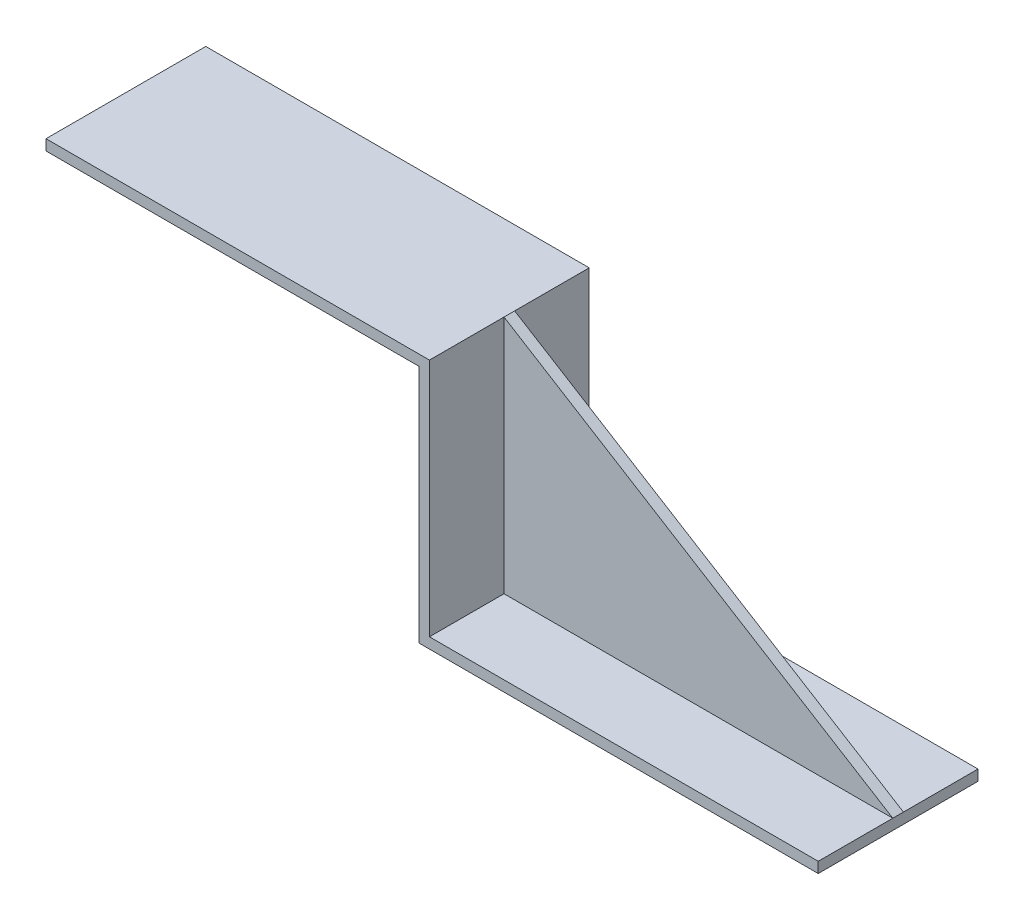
from build123d import *

# Parameters (mm, degrees)
EXTRUDE_THIN1_DEPTH = 15
RIB1_REACH          = 155.163
SKETCH2_WALL_W      = 394.082089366
SKETCH2_WALL_H      = 2


with BuildPart() as part:
    # Sketch1 → Extrude-Thin1 (new, symmetric)
    with BuildSketch(Plane.XY):
        Polygon((0, 0), (-75, 0), (-75, 45), (-145, 45), (-145, 47), (-73, 47), (-73, 2), (0, 2), align=None)
    extrude(amount=EXTRUDE_THIN1_DEPTH, both=True)

    # Sketch2 wall → Rib1 (add, up to next)
    with BuildSketch(Plane(origin=(-36.5, 24.5, 0), x_dir=(0.8512576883, -0.524747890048, 0), z_dir=(0.524747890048, 0.8512576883, 0)), mode=Mode.PRIVATE) as rib1_sk1:
        Rectangle(SKETCH2_WALL_W, SKETCH2_WALL_H)
    rib1_tool1 = extrude(rib1_sk1.sketch, amount=-RIB1_REACH, mode=Mode.PRIVATE) - part.part
    add(rib1_tool1.solids().sort_by_distance((-36.5, 24.5, 0))[0])


solid = part.part
